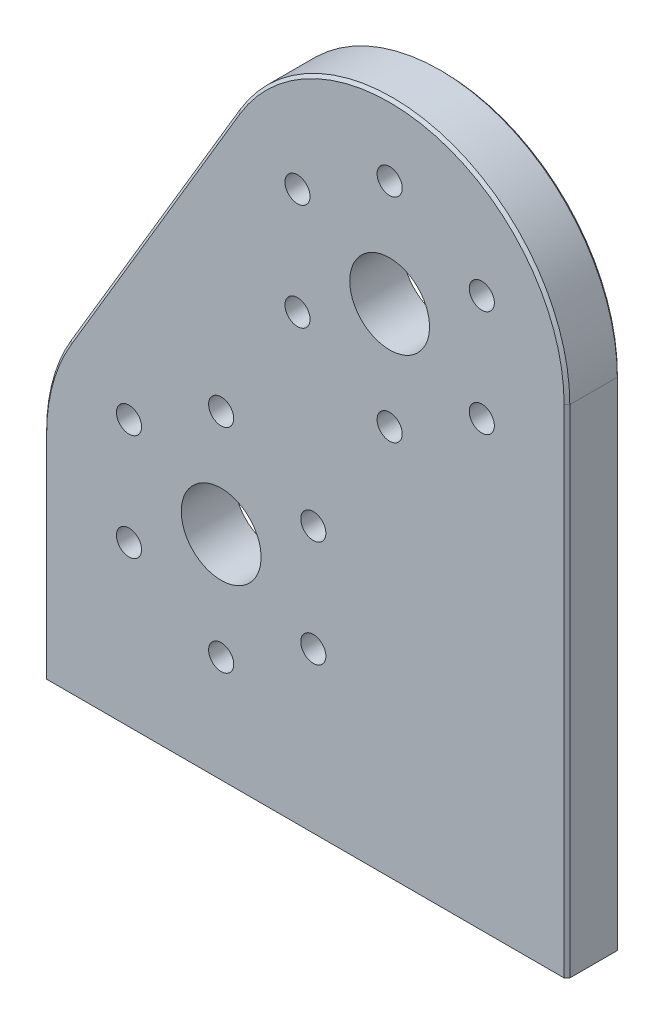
from build123d import *

# Parameters (mm, degrees)
SKETCH1_R                       = 7.14375
EXTRUDE1_DEPTH                  = 4.7625
F_8_32_TAPPED_HOLE1_D           = 3.4544
F_8_32_TAPPED_HOLE1_DEPTH       = 20.1676
F_8_32_TAPPED_HOLE1_CBORE_D     = 4.1656
F_8_32_TAPPED_HOLE1_CBORE_DEPTH = 17.78
F_8_32_TAPPED_HOLE1_TIP         = 1.037806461
F_8_CLEARANCE_HOLE1_D           = 4.4958
SKETCH6_R                       = 2.38125
CUT_EXTRUDE1_DEPTH              = 12.7
CHAMFER1_SIZE                   = 0.508


with BuildPart() as part:
    # Sketch1 → Extrude1 (new, symmetric)
    with BuildSketch(Plane.XY):
        with BuildLine():
            Line((-27.300388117, 54.309605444), (2.862111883, 105.109605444))
            ThreePointArc((2.862111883, 105.109605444), (38.567117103, 119.517395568), (61.9125, 88.9))
            Line((61.9125, 88.9), (61.9125, 0))
            Line((61.9125, 0), (-31.75, 0))
            Line((-31.75, 0), (-31.75, 38.1))
            ThreePointArc((-31.75, 38.1), (-30.617395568, 46.504617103), (-27.300388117, 54.309605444))
        make_face()
        with Locations(Location((0, 38.1, 0), (0, 0, 180))):
            Circle(SKETCH1_R, mode=Mode.SUBTRACT)
        with Locations(Location((30.1625, 88.9, 0), (0, 0, 180))):
            Circle(SKETCH1_R, mode=Mode.SUBTRACT)
    extrude(amount=EXTRUDE1_DEPTH, both=True)

    # 8-32 Tapped Hole1
    with Locations(Plane.XZ):
        with Locations((25.4, 0), (-25.4, 0)):
            CounterBoreHole(F_8_32_TAPPED_HOLE1_D / 2, F_8_32_TAPPED_HOLE1_CBORE_D / 2, F_8_32_TAPPED_HOLE1_CBORE_DEPTH, depth=F_8_32_TAPPED_HOLE1_DEPTH)
            with Locations((0, 0, -(F_8_32_TAPPED_HOLE1_DEPTH + F_8_32_TAPPED_HOLE1_TIP / 2))):  # 118° drill point
                Cone(0, F_8_32_TAPPED_HOLE1_D / 2, F_8_32_TAPPED_HOLE1_TIP, mode=Mode.SUBTRACT)

    # 8 Clearance Hole1 (through all)
    with Locations(Plane.XY.offset(4.7625)):
        with Locations((30.1625, 69.85), (13.664716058, 79.375), (46.660283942, 98.425), (30.1625, 107.95), (13.664716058, 98.425), (46.660283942, 79.375), (16.497783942, 47.625), (16.497783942, 28.575), (0, 57.15), (-16.497783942, 28.575), (-16.497783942, 47.625), (0, 19.05)):
            Hole(F_8_CLEARANCE_HOLE1_D / 2)

    # Sketch6 → Cut-Extrude1 (cut)
    with BuildSketch(Plane.XZ):
        with Locations(Location((0, 0, 0), (0, 0, 270))):
            Circle(SKETCH6_R)
        with Locations(Location((50.8, 0, 0), (0, 0, 270))):
            Circle(SKETCH6_R)
    extrude(amount=-CUT_EXTRUDE1_DEPTH, mode=Mode.SUBTRACT)

    # Chamfer1
    chamfer1_edges = [part.edges().sort_by_distance(p)[0] for p in [
        (-30.617395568, 46.504617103, 4.7625),
        (-31.75, 19.05, 4.7625),
        (61.9125, 44.45, 4.7625),
        (38.567117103, 119.517395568, 4.7625),
        (61.9125, 44.45, -4.7625),
        (-31.75, 19.05, -4.7625),
        (-30.617395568, 46.504617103, -4.7625),
        (-12.219138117, 79.709605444, 4.7625),
        (-12.219138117, 79.709605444, -4.7625),
        (38.567117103, 119.517395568, -4.7625),
    ]]
    chamfer(chamfer1_edges, length=CHAMFER1_SIZE)


solid = part.part
